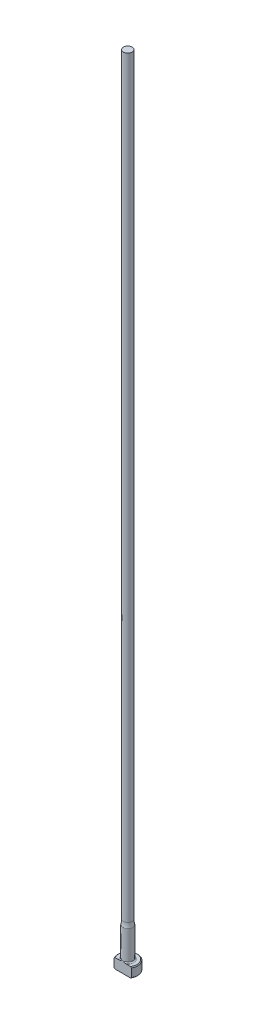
from build123d import *

# Parameters (mm, degrees)
CHAMFER1_SIZE = 0.254
FILLET1_R     = 0.381
KEY_DEPTH     = 255.0396844


with BuildPart() as part:
    # Sketch1 → Revolve1 (revolve)
    with BuildSketch(Plane.XY, mode=Mode.PRIVATE) as revolve1_sk:
        with BuildLine():
            Line((0, 0), (-3.175, 0))
            Line((-3.175, 0), (-3.175, 3.175))
            Line((-3.175, 3.175), (-1.5875, 3.175))
            Line((-1.5875, 3.175), (-1.5875, 12.7))
            ThreePointArc((-1.5875, 12.7), (-1.438154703, 13.483111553), (-1.38811, 14.278764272))
            Line((-1.38811, 14.278764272), (-1.38811, 254))
            Line((-1.38811, 254), (0, 254))
            Line((0, 254), (0, 0))
        make_face()
    revolve(revolve1_sk.sketch.rotate(Axis((0, 259.958771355, 0), (0, -1, 0)), 270), axis=Axis((0, 259.958771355, 0), (0, -1, 0)))

    # Chamfer1
    chamfer1_edges = [part.edges().sort_by_distance(p)[0] for p in [
        (0, 0, -3.175),
        (0, 3.175, -3.175),
    ]]
    chamfer(chamfer1_edges, length=CHAMFER1_SIZE)

    # Fillet1
    fillet1_edges = [part.edges().sort_by_distance(p)[0] for p in [
        (0, 3.175, -1.5875),
    ]]
    fillet(fillet1_edges, radius=FILLET1_R)

    # Sketch2 → KEY (cut, through all)
    with BuildSketch(Plane.XZ):
        with BuildLine():
            Line((-2.749630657, 1.5875), (2.749630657, 1.5875))
            ThreePointArc((2.749630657, 1.5875), (0, 3.175), (-2.749630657, 1.5875))
        make_face()
    extrude(amount=-KEY_DEPTH, mode=Mode.SUBTRACT)


solid = part.part
